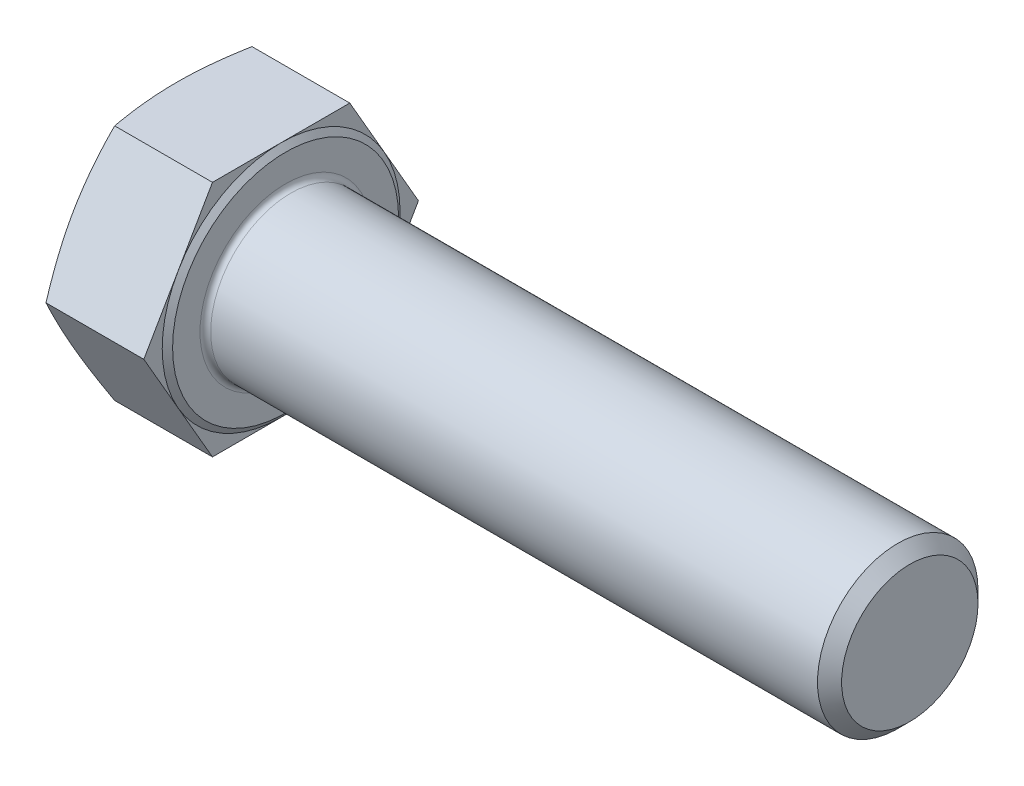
from build123d import *

# Parameters (mm, degrees)
BASEHEAD_DEPTH = 11.72
SKETCH3_R      = 9
BASEBODY_DEPTH = 70
HEADFILLET_R   = 0.6
CHAMFER1_SIZE  = 1.353


with BuildPart() as part:
    # Sketch-BaseHead → BaseHead (new body)
    with BuildSketch(Plane(origin=(0, 0, 0), x_dir=(0, 0, -1), z_dir=(1, 0, 0))):
        Polygon((15.397931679, 0), (7.69896584, 13.335), (-7.69896584, 13.335), (-15.397931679, 0), (-7.69896584, -13.335), (7.69896584, -13.335), align=None)
    extrude(amount=BASEHEAD_DEPTH)

    # Sketch4 → HeadChamfer (revolve, cut)
    with BuildSketch(Plane(origin=(-0.264637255, 0, 5.916896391), x_dir=(0, 0, -1), z_dir=(0, 1, 0))):
        Polygon((21.31482807, -0.264637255), (19.251896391, -0.264637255), (21.31482807, -1.015482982), align=None)
    revolve(axis=Axis((-4.001564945, 0, 0), (1, 0, 0)), mode=Mode.SUBTRACT)

    # Sketch1 → Revolve1 (revolve)
    with BuildSketch(Plane.XY, mode=Mode.PRIVATE) as revolve1_sk:
        Polygon((11.72, 0), (12.22, 0), (12.22, -12.67), (11.72, -13.335), align=None)
    revolve(revolve1_sk.sketch.rotate(Axis((-4.001564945, 0, 0), (1, 0, 0)), 270), axis=Axis((-4.001564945, 0, 0), (1, 0, 0)))

    # Sketch3 → BaseBody (add)
    with BuildSketch(Plane(origin=(12.22, 0, 0), x_dir=(0, 0, -1), z_dir=(1, 0, 0))):
        Circle(SKETCH3_R)
    extrude(amount=BASEBODY_DEPTH)

    # HeadFillet
    headfillet_edges = [part.edges().sort_by_distance(p)[0] for p in [
        (12.22, 0, 9),
    ]]
    fillet(headfillet_edges, radius=HEADFILLET_R)

    # Chamfer1
    chamfer1_edges = [part.edges().sort_by_distance(p)[0] for p in [
        (82.22, 0, 9),
    ]]
    chamfer(chamfer1_edges, length=CHAMFER1_SIZE)


solid = part.part
